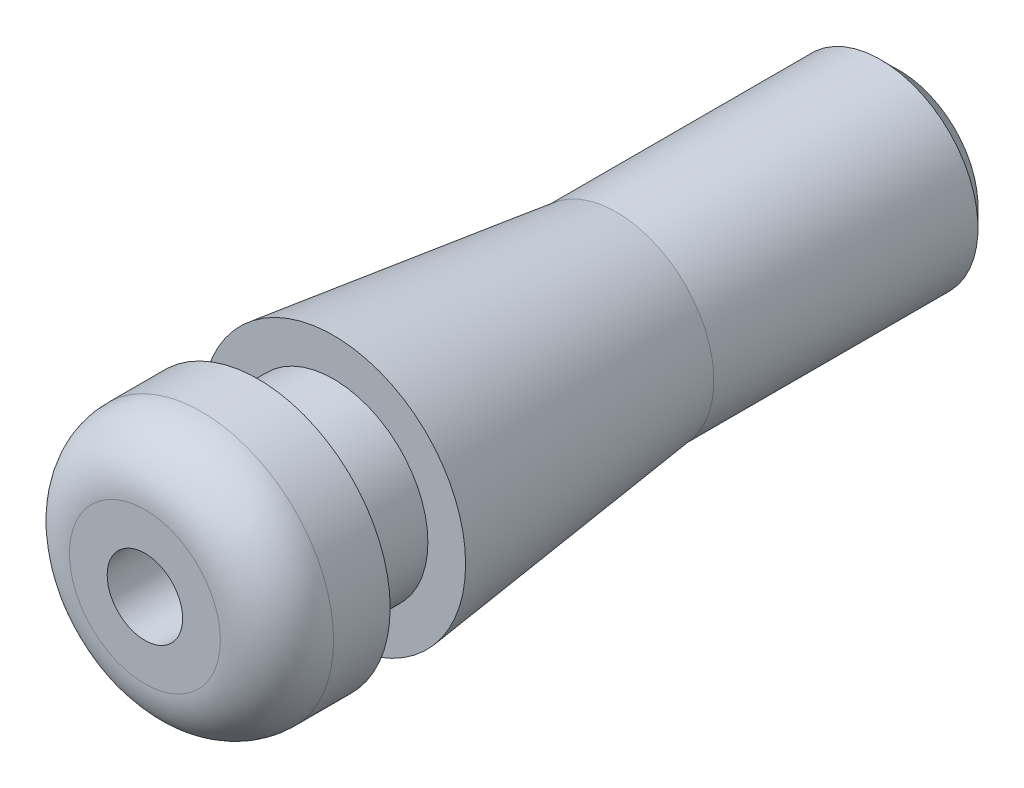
from build123d import *

# Parameters (mm, degrees)
ESQUISSE1_R             = 5
BASE_EXTRUSION_DEPTH    = 4
ESQUISSE2_R             = 7
BOSS_EXTRU_1_DEPTH      = 6
CONG_1_R                = 3
ESQUISSE3_R             = 7
BOSS_EXTRU_2_DEPTH      = 15
BOSS_EXTRU_2_TAPER      = 7
ESQUISSE4_R             = 5.158231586
BOSS_EXTRU_3_DEPTH      = 15
ESQUISSE5_R             = 2
ENL_V_MAT_EXTRU_1_DEPTH = 42.20679559
CHANFREIN1_SIZE         = 1


with BuildPart() as part:
    # Esquisse1 → Base-Extrusion (new body)
    with BuildSketch(Plane.XY):
        Circle(ESQUISSE1_R)
    extrude(amount=BASE_EXTRUSION_DEPTH)

    # Esquisse2 → Boss.-Extru.1 (add)
    with BuildSketch(Plane.XY.offset(4)):
        Circle(ESQUISSE2_R)
    extrude(amount=BOSS_EXTRU_1_DEPTH)

    # Cong_1
    cong_1_edges = [part.edges().sort_by_distance(p)[0] for p in [
        (-7, 0, 10),
    ]]
    fillet(cong_1_edges, radius=CONG_1_R)

    # Esquisse3 → Boss.-Extru.2 (add)
    with BuildSketch(Plane(origin=(0, 0, 0), x_dir=(-1, 0, 0), z_dir=(0, 0, -1))):
        with Locations(Location((0, 0, 0), (0, 0, 180))):
            Circle(ESQUISSE3_R)
    extrude(amount=BOSS_EXTRU_2_DEPTH, taper=BOSS_EXTRU_2_TAPER)

    # Esquisse4 → Boss.-Extru.3 (add)
    with BuildSketch(Plane(origin=(0, 0, -15), x_dir=(-1, 0, 0), z_dir=(0, 0, -1))):
        Circle(ESQUISSE4_R)
    extrude(amount=BOSS_EXTRU_3_DEPTH)

    # Esquisse5 → Enl_v. mat.-Extru.1 (cut, through all)
    with BuildSketch(Plane(origin=(0, 0, -30), x_dir=(-1, 0, 0), z_dir=(0, 0, -1))):
        Circle(ESQUISSE5_R)
    extrude(amount=-ENL_V_MAT_EXTRU_1_DEPTH, mode=Mode.SUBTRACT)

    # Chanfrein1
    chanfrein1_edges = [part.edges().sort_by_distance(p)[0] for p in [
        (5.158231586, 0, -30),
        (2, 0, -30),
    ]]
    chamfer(chanfrein1_edges, length=CHANFREIN1_SIZE)


solid = part.part
